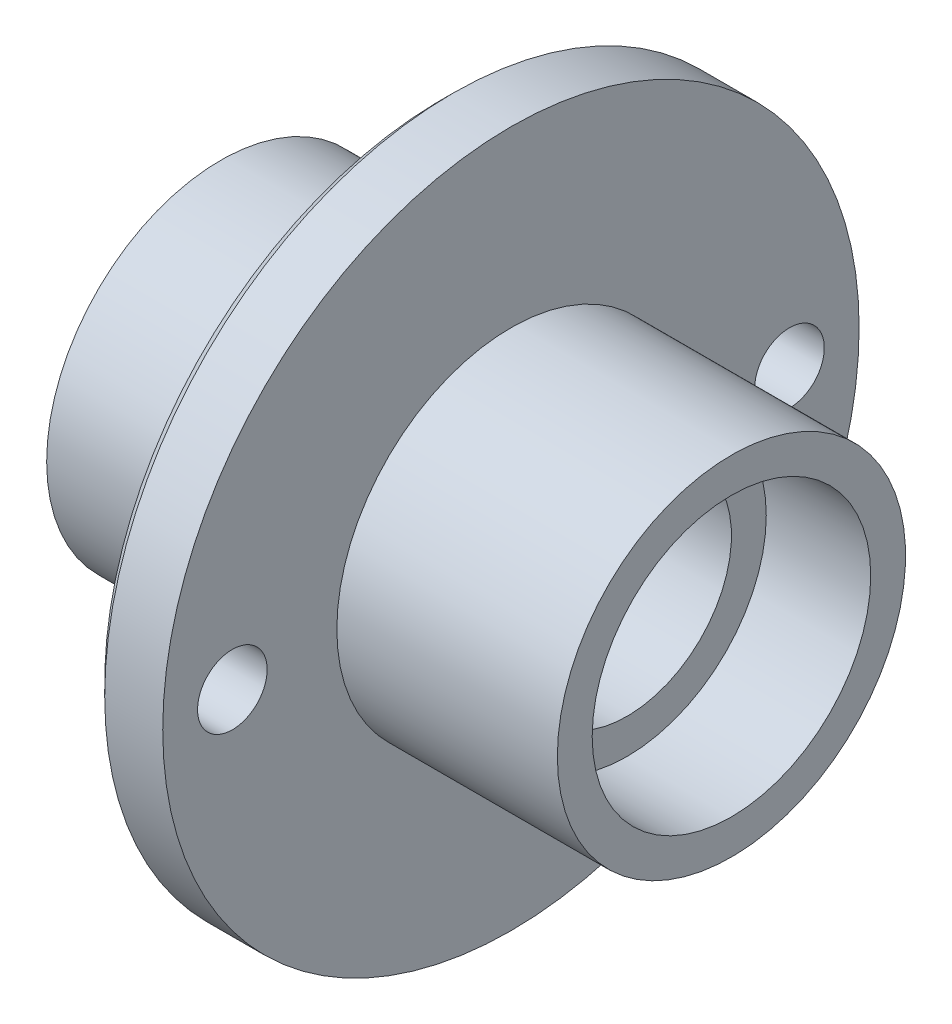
from build123d import *

# Parameters (mm, degrees)
CHANFREIN1_SIZE                   = 0.5
DIAM_TRE_DU_PER_AGE_0_15_0_15_1_D = 3
R_P_TITION_CIRCULAIRE1_COUNT      = 2


with BuildPart() as part:
    # Esquisse1 → R_volution1 (revolve)
    with BuildSketch(Plane.XY, mode=Mode.PRIVATE) as r_volution1_sk:
        Polygon((-1.5, 15), (1.5, 15), (1.5, 7.5), (11, 7.5), (11, 6), (6.5, 6), (6.5, 4.5), (-6.5, 4.5), (-6.5, 6), (-11, 6), (-11, 7.5), (-1.5, 7.5), align=None)
    revolve(r_volution1_sk.sketch.rotate(Axis((-41.536325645, 0, 0), (1, 0, 0)), 90), axis=Axis((-41.536325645, 0, 0), (1, 0, 0)))

    # Chanfrein1
    chanfrein1_edges = [part.edges().sort_by_distance(p)[0] for p in [
        (-1.5, 0, -15),
    ]]
    chamfer(chanfrein1_edges, length=CHANFREIN1_SIZE)

    # Diam_tre du per_age _0.15 _0.15_1 (through all)
    with Locations(Plane.ZY.offset(1.5)):
        with Locations((12, 0)):
            diam_tre_du_per_age_0_15_0_15_1 = Hole(DIAM_TRE_DU_PER_AGE_0_15_0_15_1_D / 2)

    # R_p_tition circulaire1: Diam_tre du per_age _0.15 _0.15_1 ×2 about axis
    r_p_tition_circulaire1_axis = Axis((0, 0, 0), (1, 0, 0))
    for i in range(1, R_P_TITION_CIRCULAIRE1_COUNT):
        add(diam_tre_du_per_age_0_15_0_15_1.rotate(r_p_tition_circulaire1_axis, i * 360 / R_P_TITION_CIRCULAIRE1_COUNT), mode=Mode.SUBTRACT)


solid = part.part
